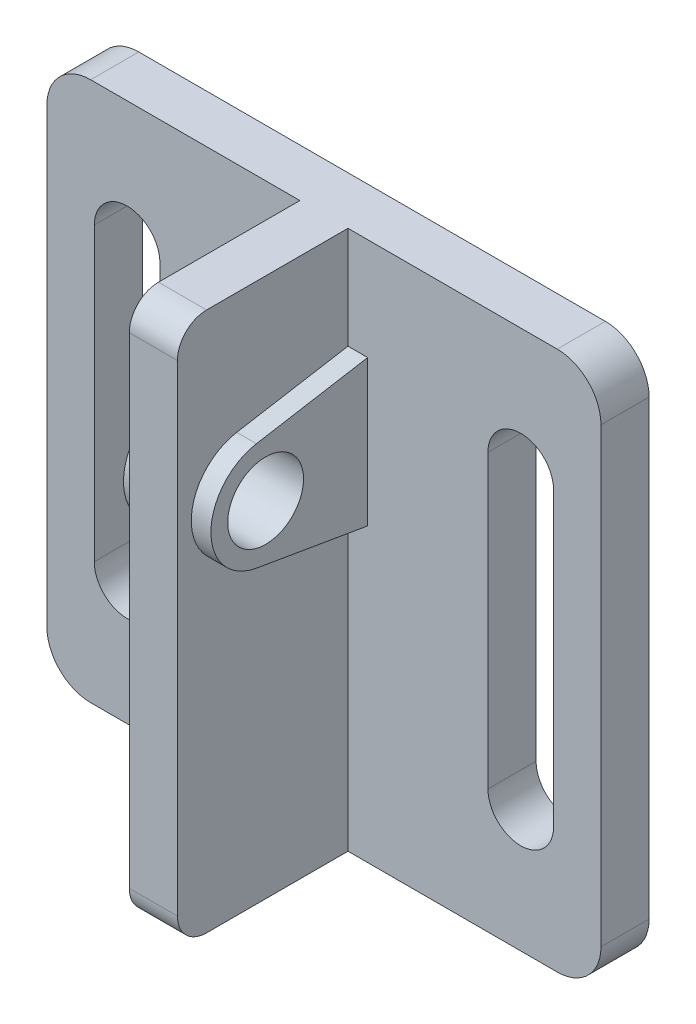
ISO-10303-21;
HEADER;
FILE_DESCRIPTION(('STEP AP214'),'2;1');
FILE_NAME('part.step','',(''),(''),'','','');
FILE_SCHEMA(('AUTOMOTIVE_DESIGN { 1 0 10303 214 1 1 1 1 }'));
ENDSEC;
DATA;
#1=APPLICATION_CONTEXT('core data for automotive mechanical design processes');
#2=APPLICATION_PROTOCOL_DEFINITION('international standard','automotive_design',2000,#1);
#3=PRODUCT_CONTEXT('',#1,'mechanical');
#4=PRODUCT('Part','Part','',(#3));
#5=PRODUCT_RELATED_PRODUCT_CATEGORY('part','',(#4));
#6=PRODUCT_DEFINITION_FORMATION('','',#4);
#7=PRODUCT_DEFINITION_CONTEXT('part definition',#1,'design');
#8=PRODUCT_DEFINITION('design','',#6,#7);
#9=PRODUCT_DEFINITION_SHAPE('','',#8);
#10=(LENGTH_UNIT() NAMED_UNIT(*) SI_UNIT(.MILLI.,.METRE.));
#11=(NAMED_UNIT(*) PLANE_ANGLE_UNIT() SI_UNIT($,.RADIAN.));
#12=(NAMED_UNIT(*) SI_UNIT($,.STERADIAN.) SOLID_ANGLE_UNIT());
#13=UNCERTAINTY_MEASURE_WITH_UNIT(LENGTH_MEASURE(1.E-05),#10,'distance_accuracy_value','');
#14=(GEOMETRIC_REPRESENTATION_CONTEXT(3) GLOBAL_UNCERTAINTY_ASSIGNED_CONTEXT((#13)) GLOBAL_UNIT_ASSIGNED_CONTEXT((#10,
#11,#12)) REPRESENTATION_CONTEXT('',''));
#15=CARTESIAN_POINT('',(0.,0.,0.));
#16=DIRECTION('',(0.,0.,1.));
#17=DIRECTION('',(1.,0.,0.));
#18=AXIS2_PLACEMENT_3D('',#15,#16,#17);
#19=CARTESIAN_POINT('',(0.,0.,3.3));
#20=DIRECTION('',(0.,0.,1.));
#21=DIRECTION('',(1.,0.,0.));
#22=AXIS2_PLACEMENT_3D('',#19,#20,#21);
#23=PLANE('',#22);
#24=CARTESIAN_POINT('',(13.5,10.,3.3));
#25=DIRECTION('',(0.,0.,1.));
#26=DIRECTION('',(-1.,0.,0.));
#27=AXIS2_PLACEMENT_3D('',#24,#25,#26);
#28=CIRCLE('',#27,2.25);
#29=CARTESIAN_POINT('',(15.75,10.,3.3));
#30=VERTEX_POINT('',#29);
#31=CARTESIAN_POINT('',(11.25,10.,3.3));
#32=VERTEX_POINT('',#31);
#33=EDGE_CURVE('E322',#30,#32,#28,.T.);
#34=ORIENTED_EDGE('',*,*,#33,.F.);
#35=DIRECTION('',(0.,1.,0.));
#36=VECTOR('',#35,1.);
#37=CARTESIAN_POINT('',(15.75,10.,3.3));
#38=LINE('',#37,#36);
#39=CARTESIAN_POINT('',(15.75,-10.,3.3));
#40=VERTEX_POINT('',#39);
#41=EDGE_CURVE('E330',#40,#30,#38,.T.);
#42=ORIENTED_EDGE('',*,*,#41,.F.);
#43=CARTESIAN_POINT('',(13.5,-10.,3.3));
#44=DIRECTION('',(0.,0.,1.));
#45=DIRECTION('',(-1.,0.,0.));
#46=AXIS2_PLACEMENT_3D('',#43,#44,#45);
#47=CIRCLE('',#46,2.25);
#48=CARTESIAN_POINT('',(11.25,-10.,3.3));
#49=VERTEX_POINT('',#48);
#50=EDGE_CURVE('E327',#49,#40,#47,.T.);
#51=ORIENTED_EDGE('',*,*,#50,.F.);
#52=DIRECTION('',(0.,-1.,0.));
#53=VECTOR('',#52,1.);
#54=CARTESIAN_POINT('',(11.25,10.,3.3));
#55=LINE('',#54,#53);
#56=EDGE_CURVE('E324',#32,#49,#55,.T.);
#57=ORIENTED_EDGE('',*,*,#56,.F.);
#58=EDGE_LOOP('',(#34,#42,#51,#57));
#59=FACE_BOUND('',#58,.T.);
#60=DIRECTION('',(0.,1.,0.));
#61=VECTOR('',#60,1.);
#62=CARTESIAN_POINT('',(1.65,18.5,3.3));
#63=LINE('',#62,#61);
#64=CARTESIAN_POINT('',(1.65,11.5,3.3));
#65=VERTEX_POINT('',#64);
#66=CARTESIAN_POINT('',(1.65,18.5,3.3));
#67=VERTEX_POINT('',#66);
#68=EDGE_CURVE('E292',#65,#67,#63,.T.);
#69=ORIENTED_EDGE('',*,*,#68,.F.);
#70=DIRECTION('',(-1.,0.,0.));
#71=VECTOR('',#70,1.);
#72=CARTESIAN_POINT('',(3.,11.5,3.3));
#73=LINE('',#72,#71);
#74=CARTESIAN_POINT('',(3.,11.5,3.3));
#75=VERTEX_POINT('',#74);
#76=EDGE_CURVE('E57',#75,#65,#73,.T.);
#77=ORIENTED_EDGE('',*,*,#76,.F.);
#78=DIRECTION('',(0.,1.,0.));
#79=VECTOR('',#78,1.);
#80=CARTESIAN_POINT('',(3.,1.5,3.3));
#81=LINE('',#80,#79);
#82=CARTESIAN_POINT('',(3.,1.5,3.3));
#83=VERTEX_POINT('',#82);
#84=EDGE_CURVE('E267',#83,#75,#81,.T.);
#85=ORIENTED_EDGE('',*,*,#84,.F.);
#86=DIRECTION('',(-1.,0.,0.));
#87=VECTOR('',#86,1.);
#88=CARTESIAN_POINT('',(3.,1.5,3.3));
#89=LINE('',#88,#87);
#90=CARTESIAN_POINT('',(1.65,1.5,3.3));
#91=VERTEX_POINT('',#90);
#92=EDGE_CURVE('E277',#83,#91,#89,.T.);
#93=ORIENTED_EDGE('',*,*,#92,.T.);
#94=CARTESIAN_POINT('',(1.65,-18.5,3.3));
#95=VERTEX_POINT('',#94);
#96=EDGE_CURVE('E301',#95,#91,#63,.T.);
#97=ORIENTED_EDGE('',*,*,#96,.F.);
#98=DIRECTION('',(1.,0.,0.));
#99=VECTOR('',#98,1.);
#100=CARTESIAN_POINT('',(-19.,-18.5,3.3));
#101=LINE('',#100,#99);
#102=CARTESIAN_POINT('',(16.,-18.5,3.3));
#103=VERTEX_POINT('',#102);
#104=EDGE_CURVE('E388',#95,#103,#101,.T.);
#105=ORIENTED_EDGE('',*,*,#104,.T.);
#106=CARTESIAN_POINT('',(16.,-15.5,3.3));
#107=DIRECTION('',(0.,0.,1.));
#108=DIRECTION('',(1.,0.,0.));
#109=AXIS2_PLACEMENT_3D('',#106,#107,#108);
#110=CIRCLE('',#109,3.);
#111=CARTESIAN_POINT('',(19.,-15.5,3.3));
#112=VERTEX_POINT('',#111);
#113=EDGE_CURVE('E424',#103,#112,#110,.T.);
#114=ORIENTED_EDGE('',*,*,#113,.T.);
#115=DIRECTION('',(0.,1.,0.));
#116=VECTOR('',#115,1.);
#117=CARTESIAN_POINT('',(19.,18.5,3.3));
#118=LINE('',#117,#116);
#119=CARTESIAN_POINT('',(19.,15.5,3.3));
#120=VERTEX_POINT('',#119);
#121=EDGE_CURVE('E377',#112,#120,#118,.T.);
#122=ORIENTED_EDGE('',*,*,#121,.T.);
#123=CARTESIAN_POINT('',(16.,15.5,3.3));
#124=DIRECTION('',(0.,0.,1.));
#125=DIRECTION('',(1.,0.,0.));
#126=AXIS2_PLACEMENT_3D('',#123,#124,#125);
#127=CIRCLE('',#126,3.);
#128=CARTESIAN_POINT('',(16.,18.5,3.3));
#129=VERTEX_POINT('',#128);
#130=EDGE_CURVE('E422',#120,#129,#127,.T.);
#131=ORIENTED_EDGE('',*,*,#130,.T.);
#132=DIRECTION('',(-1.,0.,0.));
#133=VECTOR('',#132,1.);
#134=CARTESIAN_POINT('',(-19.,18.5,3.3));
#135=LINE('',#134,#133);
#136=EDGE_CURVE('E382',#129,#67,#135,.T.);
#137=ORIENTED_EDGE('',*,*,#136,.T.);
#138=EDGE_LOOP('',(#69,#77,#85,#93,#97,#105,#114,#122,#131,#137));
#139=FACE_BOUND('',#138,.T.);
#140=ADVANCED_FACE('F34',(#59,#139),#23,.T.);
#141=CARTESIAN_POINT('',(1.65,18.5,15.));
#142=DIRECTION('',(-1.,0.,0.));
#143=DIRECTION('',(0.,0.,1.));
#144=AXIS2_PLACEMENT_3D('',#141,#142,#143);
#145=PLANE('',#144);
#146=DIRECTION('',(0.,-0.168373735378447,0.985723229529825));
#147=VECTOR('',#146,1.);
#148=CARTESIAN_POINT('',(1.65,11.5,3.3));
#149=LINE('',#148,#147);
#150=CARTESIAN_POINT('',(1.65,10.1964621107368,10.9314015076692));
#151=VERTEX_POINT('',#150);
#152=EDGE_CURVE('E258',#65,#151,#149,.T.);
#153=ORIENTED_EDGE('',*,*,#152,.F.);
#154=ORIENTED_EDGE('',*,*,#68,.T.);
#155=DIRECTION('',(0.,0.,-1.));
#156=VECTOR('',#155,1.);
#157=CARTESIAN_POINT('',(1.65,18.5,15.));
#158=LINE('',#157,#156);
#159=CARTESIAN_POINT('',(1.65,18.5,13.));
#160=VERTEX_POINT('',#159);
#161=EDGE_CURVE('E311',#160,#67,#158,.T.);
#162=ORIENTED_EDGE('',*,*,#161,.F.);
#163=CARTESIAN_POINT('',(1.65,16.5,13.));
#164=DIRECTION('',(-1.,0.,0.));
#165=DIRECTION('',(0.,0.,1.));
#166=AXIS2_PLACEMENT_3D('',#163,#164,#165);
#167=CIRCLE('',#166,2.);
#168=CARTESIAN_POINT('',(1.65,16.5,15.));
#169=VERTEX_POINT('',#168);
#170=EDGE_CURVE('E445',#160,#169,#167,.F.);
#171=ORIENTED_EDGE('',*,*,#170,.T.);
#172=DIRECTION('',(0.,1.,0.));
#173=VECTOR('',#172,1.);
#174=CARTESIAN_POINT('',(1.65,18.5,15.));
#175=LINE('',#174,#173);
#176=CARTESIAN_POINT('',(1.65,-16.5,15.));
#177=VERTEX_POINT('',#176);
#178=EDGE_CURVE('E293',#177,#169,#175,.T.);
#179=ORIENTED_EDGE('',*,*,#178,.F.);
#180=CARTESIAN_POINT('',(1.65,-16.5,13.));
#181=DIRECTION('',(-1.,0.,0.));
#182=DIRECTION('',(0.,0.,1.));
#183=AXIS2_PLACEMENT_3D('',#180,#181,#182);
#184=CIRCLE('',#183,2.);
#185=CARTESIAN_POINT('',(1.65,-18.5,13.));
#186=VERTEX_POINT('',#185);
#187=EDGE_CURVE('E447',#177,#186,#184,.F.);
#188=ORIENTED_EDGE('',*,*,#187,.T.);
#189=DIRECTION('',(0.,0.,-1.));
#190=VECTOR('',#189,1.);
#191=CARTESIAN_POINT('',(1.65,-18.5,15.));
#192=LINE('',#191,#190);
#193=EDGE_CURVE('E300',#186,#95,#192,.T.);
#194=ORIENTED_EDGE('',*,*,#193,.T.);
#195=ORIENTED_EDGE('',*,*,#96,.T.);
#196=DIRECTION('',(0.,-0.168373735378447,-0.985723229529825));
#197=VECTOR('',#196,1.);
#198=CARTESIAN_POINT('',(1.65,1.5,3.3));
#199=LINE('',#198,#197);
#200=CARTESIAN_POINT('',(1.65,2.80353788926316,10.9314015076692));
#201=VERTEX_POINT('',#200);
#202=EDGE_CURVE('E271',#201,#91,#199,.T.);
#203=ORIENTED_EDGE('',*,*,#202,.F.);
#204=CARTESIAN_POINT('',(1.65,6.5,10.3));
#205=DIRECTION('',(1.,0.,0.));
#206=DIRECTION('',(0.,0.,-1.));
#207=AXIS2_PLACEMENT_3D('',#204,#205,#206);
#208=CIRCLE('',#207,3.75);
#209=EDGE_CURVE('E261',#151,#201,#208,.T.);
#210=ORIENTED_EDGE('',*,*,#209,.F.);
#211=EDGE_LOOP('',(#153,#154,#162,#171,#179,#188,#194,#195,#203,#210));
#212=FACE_BOUND('',#211,.T.);
#213=ADVANCED_FACE('F467',(#212),#145,.F.);
#214=CARTESIAN_POINT('',(19.,18.5,3.3));
#215=DIRECTION('',(-1.,0.,0.));
#216=DIRECTION('',(0.,-1.,0.));
#217=AXIS2_PLACEMENT_3D('',#214,#215,#216);
#218=PLANE('',#217);
#219=ORIENTED_EDGE('',*,*,#121,.F.);
#220=DIRECTION('',(0.,0.,-1.));
#221=VECTOR('',#220,1.);
#222=CARTESIAN_POINT('',(19.,-15.5,3.3));
#223=LINE('',#222,#221);
#224=CARTESIAN_POINT('',(19.,-15.5,0.));
#225=VERTEX_POINT('',#224);
#226=EDGE_CURVE('E430',#112,#225,#223,.T.);
#227=ORIENTED_EDGE('',*,*,#226,.T.);
#228=DIRECTION('',(0.,1.,0.));
#229=VECTOR('',#228,1.);
#230=CARTESIAN_POINT('',(19.,18.5,0.));
#231=LINE('',#230,#229);
#232=CARTESIAN_POINT('',(19.,15.5,0.));
#233=VERTEX_POINT('',#232);
#234=EDGE_CURVE('E376',#225,#233,#231,.T.);
#235=ORIENTED_EDGE('',*,*,#234,.T.);
#236=DIRECTION('',(0.,0.,-1.));
#237=VECTOR('',#236,1.);
#238=CARTESIAN_POINT('',(19.,15.5,3.3));
#239=LINE('',#238,#237);
#240=EDGE_CURVE('E428',#233,#120,#239,.F.);
#241=ORIENTED_EDGE('',*,*,#240,.T.);
#242=EDGE_LOOP('',(#219,#227,#235,#241));
#243=FACE_BOUND('',#242,.T.);
#244=ADVANCED_FACE('F504',(#243),#218,.F.);
#245=CARTESIAN_POINT('',(-19.,18.5,3.3));
#246=DIRECTION('',(0.,-1.,0.));
#247=DIRECTION('',(0.,0.,-1.));
#248=AXIS2_PLACEMENT_3D('',#245,#246,#247);
#249=PLANE('',#248);
#250=DIRECTION('',(0.,0.,-1.));
#251=VECTOR('',#250,1.);
#252=CARTESIAN_POINT('',(-1.65,18.5,15.));
#253=LINE('',#252,#251);
#254=CARTESIAN_POINT('',(-1.65,18.5,13.));
#255=VERTEX_POINT('',#254);
#256=CARTESIAN_POINT('',(-1.65,18.5,3.3));
#257=VERTEX_POINT('',#256);
#258=EDGE_CURVE('E309',#255,#257,#253,.T.);
#259=ORIENTED_EDGE('',*,*,#258,.F.);
#260=DIRECTION('',(-1.,0.,0.));
#261=VECTOR('',#260,1.);
#262=CARTESIAN_POINT('',(1.65,18.5,13.));
#263=LINE('',#262,#261);
#264=EDGE_CURVE('E11',#255,#160,#263,.F.);
#265=ORIENTED_EDGE('',*,*,#264,.T.);
#266=ORIENTED_EDGE('',*,*,#161,.T.);
#267=ORIENTED_EDGE('',*,*,#136,.F.);
#268=DIRECTION('',(0.,0.,-1.));
#269=VECTOR('',#268,1.);
#270=CARTESIAN_POINT('',(16.,18.5,3.3));
#271=LINE('',#270,#269);
#272=CARTESIAN_POINT('',(16.,18.5,0.));
#273=VERTEX_POINT('',#272);
#274=EDGE_CURVE('E436',#129,#273,#271,.T.);
#275=ORIENTED_EDGE('',*,*,#274,.T.);
#276=DIRECTION('',(-1.,0.,0.));
#277=VECTOR('',#276,1.);
#278=CARTESIAN_POINT('',(-19.,18.5,0.));
#279=LINE('',#278,#277);
#280=CARTESIAN_POINT('',(-16.,18.5,0.));
#281=VERTEX_POINT('',#280);
#282=EDGE_CURVE('E394',#273,#281,#279,.T.);
#283=ORIENTED_EDGE('',*,*,#282,.T.);
#284=DIRECTION('',(0.,0.,-1.));
#285=VECTOR('',#284,1.);
#286=CARTESIAN_POINT('',(-16.,18.5,3.3));
#287=LINE('',#286,#285);
#288=CARTESIAN_POINT('',(-16.,18.5,3.3));
#289=VERTEX_POINT('',#288);
#290=EDGE_CURVE('E433',#281,#289,#287,.F.);
#291=ORIENTED_EDGE('',*,*,#290,.T.);
#292=EDGE_CURVE('E380',#257,#289,#135,.T.);
#293=ORIENTED_EDGE('',*,*,#292,.F.);
#294=EDGE_LOOP('',(#259,#265,#266,#267,#275,#283,#291,#293));
#295=FACE_BOUND('',#294,.T.);
#296=ADVANCED_FACE('F494',(#295),#249,.F.);
#297=CARTESIAN_POINT('',(-19.,18.5,3.3));
#298=DIRECTION('',(1.,0.,0.));
#299=DIRECTION('',(0.,1.,0.));
#300=AXIS2_PLACEMENT_3D('',#297,#298,#299);
#301=PLANE('',#300);
#302=DIRECTION('',(0.,-1.,0.));
#303=VECTOR('',#302,1.);
#304=CARTESIAN_POINT('',(-19.,18.5,0.));
#305=LINE('',#304,#303);
#306=CARTESIAN_POINT('',(-19.,15.5,0.));
#307=VERTEX_POINT('',#306);
#308=CARTESIAN_POINT('',(-19.,-15.5,0.));
#309=VERTEX_POINT('',#308);
#310=EDGE_CURVE('E397',#307,#309,#305,.T.);
#311=ORIENTED_EDGE('',*,*,#310,.T.);
#312=DIRECTION('',(0.,0.,-1.));
#313=VECTOR('',#312,1.);
#314=CARTESIAN_POINT('',(-19.,-15.5,3.3));
#315=LINE('',#314,#313);
#316=CARTESIAN_POINT('',(-19.,-15.5,3.3));
#317=VERTEX_POINT('',#316);
#318=EDGE_CURVE('E418',#309,#317,#315,.F.);
#319=ORIENTED_EDGE('',*,*,#318,.T.);
#320=DIRECTION('',(0.,-1.,0.));
#321=VECTOR('',#320,1.);
#322=CARTESIAN_POINT('',(-19.,18.5,3.3));
#323=LINE('',#322,#321);
#324=CARTESIAN_POINT('',(-19.,15.5,3.3));
#325=VERTEX_POINT('',#324);
#326=EDGE_CURVE('E385',#325,#317,#323,.T.);
#327=ORIENTED_EDGE('',*,*,#326,.F.);
#328=DIRECTION('',(0.,0.,-1.));
#329=VECTOR('',#328,1.);
#330=CARTESIAN_POINT('',(-19.,15.5,3.3));
#331=LINE('',#330,#329);
#332=EDGE_CURVE('E415',#325,#307,#331,.T.);
#333=ORIENTED_EDGE('',*,*,#332,.T.);
#334=EDGE_LOOP('',(#311,#319,#327,#333));
#335=FACE_BOUND('',#334,.T.);
#336=ADVANCED_FACE('F516',(#335),#301,.F.);
#337=CARTESIAN_POINT('',(-19.,-18.5,3.3));
#338=DIRECTION('',(0.,1.,0.));
#339=DIRECTION('',(0.,0.,1.));
#340=AXIS2_PLACEMENT_3D('',#337,#338,#339);
#341=PLANE('',#340);
#342=ORIENTED_EDGE('',*,*,#193,.F.);
#343=DIRECTION('',(1.,0.,0.));
#344=VECTOR('',#343,1.);
#345=CARTESIAN_POINT('',(-1.65,-18.5,13.));
#346=LINE('',#345,#344);
#347=CARTESIAN_POINT('',(-1.65,-18.5,13.));
#348=VERTEX_POINT('',#347);
#349=EDGE_CURVE('E449',#186,#348,#346,.F.);
#350=ORIENTED_EDGE('',*,*,#349,.T.);
#351=DIRECTION('',(0.,0.,-1.));
#352=VECTOR('',#351,1.);
#353=CARTESIAN_POINT('',(-1.65,-18.5,15.));
#354=LINE('',#353,#352);
#355=CARTESIAN_POINT('',(-1.65,-18.5,3.3));
#356=VERTEX_POINT('',#355);
#357=EDGE_CURVE('E306',#348,#356,#354,.T.);
#358=ORIENTED_EDGE('',*,*,#357,.T.);
#359=CARTESIAN_POINT('',(-16.,-18.5,3.3));
#360=VERTEX_POINT('',#359);
#361=EDGE_CURVE('E389',#360,#356,#101,.T.);
#362=ORIENTED_EDGE('',*,*,#361,.F.);
#363=DIRECTION('',(0.,0.,-1.));
#364=VECTOR('',#363,1.);
#365=CARTESIAN_POINT('',(-16.,-18.5,3.3));
#366=LINE('',#365,#364);
#367=CARTESIAN_POINT('',(-16.,-18.5,0.));
#368=VERTEX_POINT('',#367);
#369=EDGE_CURVE('E404',#360,#368,#366,.T.);
#370=ORIENTED_EDGE('',*,*,#369,.T.);
#371=DIRECTION('',(1.,0.,0.));
#372=VECTOR('',#371,1.);
#373=CARTESIAN_POINT('',(-19.,-18.5,0.));
#374=LINE('',#373,#372);
#375=CARTESIAN_POINT('',(16.,-18.5,0.));
#376=VERTEX_POINT('',#375);
#377=EDGE_CURVE('E381',#368,#376,#374,.T.);
#378=ORIENTED_EDGE('',*,*,#377,.T.);
#379=DIRECTION('',(0.,0.,-1.));
#380=VECTOR('',#379,1.);
#381=CARTESIAN_POINT('',(16.,-18.5,3.3));
#382=LINE('',#381,#380);
#383=EDGE_CURVE('E391',#376,#103,#382,.F.);
#384=ORIENTED_EDGE('',*,*,#383,.T.);
#385=ORIENTED_EDGE('',*,*,#104,.F.);
#386=EDGE_LOOP('',(#342,#350,#358,#362,#370,#378,#384,#385));
#387=FACE_BOUND('',#386,.T.);
#388=ADVANCED_FACE('F471',(#387),#341,.F.);
#389=DIRECTION('',(1.,0.,0.));
#390=VECTOR('',#389,1.);
#391=CARTESIAN_POINT('',(-3.,1.5,3.3));
#392=LINE('',#391,#390);
#393=CARTESIAN_POINT('',(-3.,1.5,3.3));
#394=VERTEX_POINT('',#393);
#395=CARTESIAN_POINT('',(-1.65,1.5,3.3));
#396=VERTEX_POINT('',#395);
#397=EDGE_CURVE('E248',#394,#396,#392,.T.);
#398=ORIENTED_EDGE('',*,*,#397,.F.);
#399=DIRECTION('',(0.,1.,0.));
#400=VECTOR('',#399,1.);
#401=CARTESIAN_POINT('',(-3.,1.5,3.3));
#402=LINE('',#401,#400);
#403=CARTESIAN_POINT('',(-3.,11.5,3.3));
#404=VERTEX_POINT('',#403);
#405=EDGE_CURVE('E232',#394,#404,#402,.T.);
#406=ORIENTED_EDGE('',*,*,#405,.T.);
#407=DIRECTION('',(1.,0.,0.));
#408=VECTOR('',#407,1.);
#409=CARTESIAN_POINT('',(-3.,11.5,3.3));
#410=LINE('',#409,#408);
#411=CARTESIAN_POINT('',(-1.65,11.5,3.3));
#412=VERTEX_POINT('',#411);
#413=EDGE_CURVE('E526',#404,#412,#410,.T.);
#414=ORIENTED_EDGE('',*,*,#413,.T.);
#415=DIRECTION('',(0.,-1.,0.));
#416=VECTOR('',#415,1.);
#417=CARTESIAN_POINT('',(-1.65,18.5,3.3));
#418=LINE('',#417,#416);
#419=EDGE_CURVE('E297',#257,#412,#418,.T.);
#420=ORIENTED_EDGE('',*,*,#419,.F.);
#421=ORIENTED_EDGE('',*,*,#292,.T.);
#422=CARTESIAN_POINT('',(-16.,15.5,3.3));
#423=DIRECTION('',(0.,0.,1.));
#424=DIRECTION('',(1.,0.,0.));
#425=AXIS2_PLACEMENT_3D('',#422,#423,#424);
#426=CIRCLE('',#425,3.);
#427=EDGE_CURVE('E420',#289,#325,#426,.T.);
#428=ORIENTED_EDGE('',*,*,#427,.T.);
#429=ORIENTED_EDGE('',*,*,#326,.T.);
#430=CARTESIAN_POINT('',(-16.,-15.5,3.3));
#431=DIRECTION('',(0.,0.,1.));
#432=DIRECTION('',(1.,0.,0.));
#433=AXIS2_PLACEMENT_3D('',#430,#431,#432);
#434=CIRCLE('',#433,3.);
#435=EDGE_CURVE('E426',#317,#360,#434,.T.);
#436=ORIENTED_EDGE('',*,*,#435,.T.);
#437=ORIENTED_EDGE('',*,*,#361,.T.);
#438=EDGE_CURVE('E257',#396,#356,#418,.T.);
#439=ORIENTED_EDGE('',*,*,#438,.F.);
#440=EDGE_LOOP('',(#398,#406,#414,#420,#421,#428,#429,#436,#437,#439));
#441=FACE_BOUND('',#440,.T.);
#442=CARTESIAN_POINT('',(-13.5,10.,3.3));
#443=DIRECTION('',(0.,0.,1.));
#444=DIRECTION('',(1.,0.,0.));
#445=AXIS2_PLACEMENT_3D('',#442,#443,#444);
#446=CIRCLE('',#445,2.25);
#447=CARTESIAN_POINT('',(-11.25,10.,3.3));
#448=VERTEX_POINT('',#447);
#449=CARTESIAN_POINT('',(-15.75,9.99999999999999,3.3));
#450=VERTEX_POINT('',#449);
#451=EDGE_CURVE('E353',#448,#450,#446,.T.);
#452=ORIENTED_EDGE('',*,*,#451,.F.);
#453=DIRECTION('',(0.,1.,0.));
#454=VECTOR('',#453,1.);
#455=CARTESIAN_POINT('',(-11.25,10.,3.3));
#456=LINE('',#455,#454);
#457=CARTESIAN_POINT('',(-11.25,-10.,3.3));
#458=VERTEX_POINT('',#457);
#459=EDGE_CURVE('E361',#458,#448,#456,.T.);
#460=ORIENTED_EDGE('',*,*,#459,.F.);
#461=CARTESIAN_POINT('',(-13.5,-10.,3.3));
#462=DIRECTION('',(0.,0.,1.));
#463=DIRECTION('',(1.,0.,0.));
#464=AXIS2_PLACEMENT_3D('',#461,#462,#463);
#465=CIRCLE('',#464,2.25);
#466=CARTESIAN_POINT('',(-15.75,-10.,3.3));
#467=VERTEX_POINT('',#466);
#468=EDGE_CURVE('E358',#467,#458,#465,.T.);
#469=ORIENTED_EDGE('',*,*,#468,.F.);
#470=DIRECTION('',(0.,-1.,0.));
#471=VECTOR('',#470,1.);
#472=CARTESIAN_POINT('',(-15.75,9.99999999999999,3.3));
#473=LINE('',#472,#471);
#474=EDGE_CURVE('E355',#450,#467,#473,.T.);
#475=ORIENTED_EDGE('',*,*,#474,.F.);
#476=EDGE_LOOP('',(#452,#460,#469,#475));
#477=FACE_BOUND('',#476,.T.);
#478=ADVANCED_FACE('F254',(#441,#477),#23,.T.);
#479=CARTESIAN_POINT('',(0.,0.,0.));
#480=DIRECTION('',(0.,0.,1.));
#481=DIRECTION('',(1.,0.,0.));
#482=AXIS2_PLACEMENT_3D('',#479,#480,#481);
#483=PLANE('',#482);
#484=DIRECTION('',(0.,-1.,0.));
#485=VECTOR('',#484,1.);
#486=CARTESIAN_POINT('',(15.75,10.,0.));
#487=LINE('',#486,#485);
#488=CARTESIAN_POINT('',(15.75,10.,0.));
#489=VERTEX_POINT('',#488);
#490=CARTESIAN_POINT('',(15.75,-10.,0.));
#491=VERTEX_POINT('',#490);
#492=EDGE_CURVE('E316',#489,#491,#487,.T.);
#493=ORIENTED_EDGE('',*,*,#492,.F.);
#494=CARTESIAN_POINT('',(13.5,10.,0.));
#495=DIRECTION('',(0.,0.,1.));
#496=DIRECTION('',(1.,0.,0.));
#497=AXIS2_PLACEMENT_3D('',#494,#495,#496);
#498=CIRCLE('',#497,2.25);
#499=CARTESIAN_POINT('',(11.25,10.,0.));
#500=VERTEX_POINT('',#499);
#501=EDGE_CURVE('E319',#500,#489,#498,.F.);
#502=ORIENTED_EDGE('',*,*,#501,.F.);
#503=DIRECTION('',(0.,1.,0.));
#504=VECTOR('',#503,1.);
#505=CARTESIAN_POINT('',(11.25,10.,0.));
#506=LINE('',#505,#504);
#507=CARTESIAN_POINT('',(11.25,-10.,0.));
#508=VERTEX_POINT('',#507);
#509=EDGE_CURVE('E336',#508,#500,#506,.T.);
#510=ORIENTED_EDGE('',*,*,#509,.F.);
#511=CARTESIAN_POINT('',(13.5,-10.,0.));
#512=DIRECTION('',(0.,0.,1.));
#513=DIRECTION('',(1.,0.,0.));
#514=AXIS2_PLACEMENT_3D('',#511,#512,#513);
#515=CIRCLE('',#514,2.25);
#516=EDGE_CURVE('E314',#491,#508,#515,.F.);
#517=ORIENTED_EDGE('',*,*,#516,.F.);
#518=EDGE_LOOP('',(#493,#502,#510,#517));
#519=FACE_BOUND('',#518,.T.);
#520=DIRECTION('',(0.,-1.,0.));
#521=VECTOR('',#520,1.);
#522=CARTESIAN_POINT('',(-11.25,10.,0.));
#523=LINE('',#522,#521);
#524=CARTESIAN_POINT('',(-11.25,10.,0.));
#525=VERTEX_POINT('',#524);
#526=CARTESIAN_POINT('',(-11.25,-10.,0.));
#527=VERTEX_POINT('',#526);
#528=EDGE_CURVE('E347',#525,#527,#523,.T.);
#529=ORIENTED_EDGE('',*,*,#528,.F.);
#530=CARTESIAN_POINT('',(-13.5,10.,0.));
#531=DIRECTION('',(0.,0.,1.));
#532=DIRECTION('',(1.,0.,0.));
#533=AXIS2_PLACEMENT_3D('',#530,#531,#532);
#534=CIRCLE('',#533,2.25);
#535=CARTESIAN_POINT('',(-15.75,9.99999999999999,0.));
#536=VERTEX_POINT('',#535);
#537=EDGE_CURVE('E350',#536,#525,#534,.F.);
#538=ORIENTED_EDGE('',*,*,#537,.F.);
#539=DIRECTION('',(0.,1.,0.));
#540=VECTOR('',#539,1.);
#541=CARTESIAN_POINT('',(-15.75,9.99999999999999,0.));
#542=LINE('',#541,#540);
#543=CARTESIAN_POINT('',(-15.75,-10.,0.));
#544=VERTEX_POINT('',#543);
#545=EDGE_CURVE('E367',#544,#536,#542,.T.);
#546=ORIENTED_EDGE('',*,*,#545,.F.);
#547=CARTESIAN_POINT('',(-13.5,-10.,0.));
#548=DIRECTION('',(0.,0.,1.));
#549=DIRECTION('',(1.,0.,0.));
#550=AXIS2_PLACEMENT_3D('',#547,#548,#549);
#551=CIRCLE('',#550,2.25);
#552=EDGE_CURVE('E345',#527,#544,#551,.F.);
#553=ORIENTED_EDGE('',*,*,#552,.F.);
#554=EDGE_LOOP('',(#529,#538,#546,#553));
#555=FACE_BOUND('',#554,.T.);
#556=ORIENTED_EDGE('',*,*,#377,.F.);
#557=CARTESIAN_POINT('',(-16.,-15.5,0.));
#558=DIRECTION('',(0.,0.,1.));
#559=DIRECTION('',(1.,0.,0.));
#560=AXIS2_PLACEMENT_3D('',#557,#558,#559);
#561=CIRCLE('',#560,3.);
#562=EDGE_CURVE('E413',#368,#309,#561,.F.);
#563=ORIENTED_EDGE('',*,*,#562,.T.);
#564=ORIENTED_EDGE('',*,*,#310,.F.);
#565=CARTESIAN_POINT('',(-16.,15.5,0.));
#566=DIRECTION('',(0.,0.,1.));
#567=DIRECTION('',(1.,0.,0.));
#568=AXIS2_PLACEMENT_3D('',#565,#566,#567);
#569=CIRCLE('',#568,3.);
#570=EDGE_CURVE('E407',#307,#281,#569,.F.);
#571=ORIENTED_EDGE('',*,*,#570,.T.);
#572=ORIENTED_EDGE('',*,*,#282,.F.);
#573=CARTESIAN_POINT('',(16.,15.5,0.));
#574=DIRECTION('',(0.,0.,1.));
#575=DIRECTION('',(1.,0.,0.));
#576=AXIS2_PLACEMENT_3D('',#573,#574,#575);
#577=CIRCLE('',#576,3.);
#578=EDGE_CURVE('E409',#273,#233,#577,.F.);
#579=ORIENTED_EDGE('',*,*,#578,.T.);
#580=ORIENTED_EDGE('',*,*,#234,.F.);
#581=CARTESIAN_POINT('',(16.,-15.5,0.));
#582=DIRECTION('',(0.,0.,1.));
#583=DIRECTION('',(1.,0.,0.));
#584=AXIS2_PLACEMENT_3D('',#581,#582,#583);
#585=CIRCLE('',#584,3.);
#586=EDGE_CURVE('E411',#225,#376,#585,.F.);
#587=ORIENTED_EDGE('',*,*,#586,.T.);
#588=EDGE_LOOP('',(#556,#563,#564,#571,#572,#579,#580,#587));
#589=FACE_BOUND('',#588,.T.);
#590=ADVANCED_FACE('F502',(#519,#555,#589),#483,.F.);
#591=CARTESIAN_POINT('',(-16.,-15.5,3.3));
#592=DIRECTION('',(0.,0.,-1.));
#593=DIRECTION('',(-1.,0.,0.));
#594=AXIS2_PLACEMENT_3D('',#591,#592,#593);
#595=CYLINDRICAL_SURFACE('',#594,3.);
#596=ORIENTED_EDGE('',*,*,#435,.F.);
#597=ORIENTED_EDGE('',*,*,#318,.F.);
#598=ORIENTED_EDGE('',*,*,#562,.F.);
#599=ORIENTED_EDGE('',*,*,#369,.F.);
#600=EDGE_LOOP('',(#596,#597,#598,#599));
#601=FACE_BOUND('',#600,.T.);
#602=ADVANCED_FACE('F512',(#601),#595,.T.);
#603=CARTESIAN_POINT('',(16.,-15.5,3.3));
#604=DIRECTION('',(0.,0.,-1.));
#605=DIRECTION('',(-1.,0.,0.));
#606=AXIS2_PLACEMENT_3D('',#603,#604,#605);
#607=CYLINDRICAL_SURFACE('',#606,3.);
#608=ORIENTED_EDGE('',*,*,#113,.F.);
#609=ORIENTED_EDGE('',*,*,#383,.F.);
#610=ORIENTED_EDGE('',*,*,#586,.F.);
#611=ORIENTED_EDGE('',*,*,#226,.F.);
#612=EDGE_LOOP('',(#608,#609,#610,#611));
#613=FACE_BOUND('',#612,.T.);
#614=ADVANCED_FACE('F507',(#613),#607,.T.);
#615=CARTESIAN_POINT('',(16.,15.5,3.3));
#616=DIRECTION('',(0.,0.,-1.));
#617=DIRECTION('',(-1.,0.,0.));
#618=AXIS2_PLACEMENT_3D('',#615,#616,#617);
#619=CYLINDRICAL_SURFACE('',#618,3.);
#620=ORIENTED_EDGE('',*,*,#130,.F.);
#621=ORIENTED_EDGE('',*,*,#240,.F.);
#622=ORIENTED_EDGE('',*,*,#578,.F.);
#623=ORIENTED_EDGE('',*,*,#274,.F.);
#624=EDGE_LOOP('',(#620,#621,#622,#623));
#625=FACE_BOUND('',#624,.T.);
#626=ADVANCED_FACE('F497',(#625),#619,.T.);
#627=CARTESIAN_POINT('',(-16.,15.5,3.3));
#628=DIRECTION('',(0.,0.,-1.));
#629=DIRECTION('',(-1.,0.,0.));
#630=AXIS2_PLACEMENT_3D('',#627,#628,#629);
#631=CYLINDRICAL_SURFACE('',#630,3.);
#632=ORIENTED_EDGE('',*,*,#427,.F.);
#633=ORIENTED_EDGE('',*,*,#290,.F.);
#634=ORIENTED_EDGE('',*,*,#570,.F.);
#635=ORIENTED_EDGE('',*,*,#332,.F.);
#636=EDGE_LOOP('',(#632,#633,#634,#635));
#637=FACE_BOUND('',#636,.T.);
#638=ADVANCED_FACE('F521',(#637),#631,.T.);
#639=CARTESIAN_POINT('',(-13.5,10.,-0.00100000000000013));
#640=DIRECTION('',(0.,0.,1.));
#641=DIRECTION('',(1.,0.,0.));
#642=AXIS2_PLACEMENT_3D('',#639,#640,#641);
#643=CYLINDRICAL_SURFACE('',#642,2.25);
#644=ORIENTED_EDGE('',*,*,#537,.T.);
#645=DIRECTION('',(0.,0.,1.));
#646=VECTOR('',#645,1.);
#647=CARTESIAN_POINT('',(-11.25,10.,-0.00100000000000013));
#648=LINE('',#647,#646);
#649=EDGE_CURVE('E365',#525,#448,#648,.T.);
#650=ORIENTED_EDGE('',*,*,#649,.T.);
#651=ORIENTED_EDGE('',*,*,#451,.T.);
#652=DIRECTION('',(0.,0.,1.));
#653=VECTOR('',#652,1.);
#654=CARTESIAN_POINT('',(-15.75,9.99999999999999,-0.00100000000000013));
#655=LINE('',#654,#653);
#656=EDGE_CURVE('E364',#536,#450,#655,.T.);
#657=ORIENTED_EDGE('',*,*,#656,.F.);
#658=EDGE_LOOP('',(#644,#650,#651,#657));
#659=FACE_BOUND('',#658,.T.);
#660=ADVANCED_FACE('F569',(#659),#643,.F.);
#661=CARTESIAN_POINT('',(-11.25,10.,-0.00100000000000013));
#662=DIRECTION('',(1.,0.,0.));
#663=DIRECTION('',(0.,1.,0.));
#664=AXIS2_PLACEMENT_3D('',#661,#662,#663);
#665=PLANE('',#664);
#666=ORIENTED_EDGE('',*,*,#528,.T.);
#667=DIRECTION('',(0.,0.,1.));
#668=VECTOR('',#667,1.);
#669=CARTESIAN_POINT('',(-11.25,-10.,-0.00100000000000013));
#670=LINE('',#669,#668);
#671=EDGE_CURVE('E368',#527,#458,#670,.T.);
#672=ORIENTED_EDGE('',*,*,#671,.T.);
#673=ORIENTED_EDGE('',*,*,#459,.T.);
#674=ORIENTED_EDGE('',*,*,#649,.F.);
#675=EDGE_LOOP('',(#666,#672,#673,#674));
#676=FACE_BOUND('',#675,.T.);
#677=ADVANCED_FACE('F573',(#676),#665,.F.);
#678=CARTESIAN_POINT('',(-13.5,-10.,-0.00100000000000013));
#679=DIRECTION('',(0.,0.,1.));
#680=DIRECTION('',(1.,0.,0.));
#681=AXIS2_PLACEMENT_3D('',#678,#679,#680);
#682=CYLINDRICAL_SURFACE('',#681,2.25);
#683=ORIENTED_EDGE('',*,*,#552,.T.);
#684=DIRECTION('',(0.,0.,1.));
#685=VECTOR('',#684,1.);
#686=CARTESIAN_POINT('',(-15.75,-10.,-0.00100000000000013));
#687=LINE('',#686,#685);
#688=EDGE_CURVE('E370',#544,#467,#687,.T.);
#689=ORIENTED_EDGE('',*,*,#688,.T.);
#690=ORIENTED_EDGE('',*,*,#468,.T.);
#691=ORIENTED_EDGE('',*,*,#671,.F.);
#692=EDGE_LOOP('',(#683,#689,#690,#691));
#693=FACE_BOUND('',#692,.T.);
#694=ADVANCED_FACE('F578',(#693),#682,.F.);
#695=CARTESIAN_POINT('',(-15.75,9.99999999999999,-0.00100000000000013));
#696=DIRECTION('',(-1.,0.,0.));
#697=DIRECTION('',(0.,-1.,0.));
#698=AXIS2_PLACEMENT_3D('',#695,#696,#697);
#699=PLANE('',#698);
#700=ORIENTED_EDGE('',*,*,#545,.T.);
#701=ORIENTED_EDGE('',*,*,#656,.T.);
#702=ORIENTED_EDGE('',*,*,#474,.T.);
#703=ORIENTED_EDGE('',*,*,#688,.F.);
#704=EDGE_LOOP('',(#700,#701,#702,#703));
#705=FACE_BOUND('',#704,.T.);
#706=ADVANCED_FACE('F582',(#705),#699,.F.);
#707=CARTESIAN_POINT('',(13.5,10.,-0.00100000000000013));
#708=DIRECTION('',(0.,0.,1.));
#709=DIRECTION('',(1.,0.,0.));
#710=AXIS2_PLACEMENT_3D('',#707,#708,#709);
#711=CYLINDRICAL_SURFACE('',#710,2.25);
#712=ORIENTED_EDGE('',*,*,#501,.T.);
#713=DIRECTION('',(0.,0.,1.));
#714=VECTOR('',#713,1.);
#715=CARTESIAN_POINT('',(15.75,10.,-0.00100000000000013));
#716=LINE('',#715,#714);
#717=EDGE_CURVE('E334',#489,#30,#716,.T.);
#718=ORIENTED_EDGE('',*,*,#717,.T.);
#719=ORIENTED_EDGE('',*,*,#33,.T.);
#720=DIRECTION('',(0.,0.,1.));
#721=VECTOR('',#720,1.);
#722=CARTESIAN_POINT('',(11.25,10.,-0.00100000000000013));
#723=LINE('',#722,#721);
#724=EDGE_CURVE('E333',#500,#32,#723,.T.);
#725=ORIENTED_EDGE('',*,*,#724,.F.);
#726=EDGE_LOOP('',(#712,#718,#719,#725));
#727=FACE_BOUND('',#726,.T.);
#728=ADVANCED_FACE('F585',(#727),#711,.F.);
#729=CARTESIAN_POINT('',(15.75,10.,-0.00100000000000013));
#730=DIRECTION('',(1.,0.,0.));
#731=DIRECTION('',(0.,0.,-1.));
#732=AXIS2_PLACEMENT_3D('',#729,#730,#731);
#733=PLANE('',#732);
#734=ORIENTED_EDGE('',*,*,#492,.T.);
#735=DIRECTION('',(0.,0.,1.));
#736=VECTOR('',#735,1.);
#737=CARTESIAN_POINT('',(15.75,-10.,-0.00100000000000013));
#738=LINE('',#737,#736);
#739=EDGE_CURVE('E337',#491,#40,#738,.T.);
#740=ORIENTED_EDGE('',*,*,#739,.T.);
#741=ORIENTED_EDGE('',*,*,#41,.T.);
#742=ORIENTED_EDGE('',*,*,#717,.F.);
#743=EDGE_LOOP('',(#734,#740,#741,#742));
#744=FACE_BOUND('',#743,.T.);
#745=ADVANCED_FACE('F592',(#744),#733,.F.);
#746=CARTESIAN_POINT('',(13.5,-10.,-0.00100000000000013));
#747=DIRECTION('',(0.,0.,1.));
#748=DIRECTION('',(1.,0.,0.));
#749=AXIS2_PLACEMENT_3D('',#746,#747,#748);
#750=CYLINDRICAL_SURFACE('',#749,2.25);
#751=ORIENTED_EDGE('',*,*,#516,.T.);
#752=DIRECTION('',(0.,0.,1.));
#753=VECTOR('',#752,1.);
#754=CARTESIAN_POINT('',(11.25,-10.,-0.00100000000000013));
#755=LINE('',#754,#753);
#756=EDGE_CURVE('E339',#508,#49,#755,.T.);
#757=ORIENTED_EDGE('',*,*,#756,.T.);
#758=ORIENTED_EDGE('',*,*,#50,.T.);
#759=ORIENTED_EDGE('',*,*,#739,.F.);
#760=EDGE_LOOP('',(#751,#757,#758,#759));
#761=FACE_BOUND('',#760,.T.);
#762=ADVANCED_FACE('F597',(#761),#750,.F.);
#763=CARTESIAN_POINT('',(11.25,10.,-0.00100000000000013));
#764=DIRECTION('',(-1.,0.,0.));
#765=DIRECTION('',(0.,0.,1.));
#766=AXIS2_PLACEMENT_3D('',#763,#764,#765);
#767=PLANE('',#766);
#768=ORIENTED_EDGE('',*,*,#509,.T.);
#769=ORIENTED_EDGE('',*,*,#724,.T.);
#770=ORIENTED_EDGE('',*,*,#56,.T.);
#771=ORIENTED_EDGE('',*,*,#756,.F.);
#772=EDGE_LOOP('',(#768,#769,#770,#771));
#773=FACE_BOUND('',#772,.T.);
#774=ADVANCED_FACE('F594',(#773),#767,.F.);
#775=CARTESIAN_POINT('',(-1.65,18.5,15.));
#776=DIRECTION('',(1.,0.,0.));
#777=DIRECTION('',(0.,0.,-1.));
#778=AXIS2_PLACEMENT_3D('',#775,#776,#777);
#779=PLANE('',#778);
#780=CARTESIAN_POINT('',(-1.65,6.5,10.3));
#781=DIRECTION('',(1.,0.,0.));
#782=DIRECTION('',(0.,0.,-1.));
#783=AXIS2_PLACEMENT_3D('',#780,#781,#782);
#784=CIRCLE('',#783,3.75);
#785=CARTESIAN_POINT('',(-1.65,10.1964621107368,10.9314015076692));
#786=VERTEX_POINT('',#785);
#787=CARTESIAN_POINT('',(-1.65,2.80353788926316,10.9314015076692));
#788=VERTEX_POINT('',#787);
#789=EDGE_CURVE('E49',#786,#788,#784,.T.);
#790=ORIENTED_EDGE('',*,*,#789,.T.);
#791=DIRECTION('',(0.,-0.168373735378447,-0.985723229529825));
#792=VECTOR('',#791,1.);
#793=CARTESIAN_POINT('',(-1.65,1.5,3.3));
#794=LINE('',#793,#792);
#795=EDGE_CURVE('E640',#788,#396,#794,.T.);
#796=ORIENTED_EDGE('',*,*,#795,.T.);
#797=ORIENTED_EDGE('',*,*,#438,.T.);
#798=ORIENTED_EDGE('',*,*,#357,.F.);
#799=CARTESIAN_POINT('',(-1.65,-16.5,13.));
#800=DIRECTION('',(1.,0.,0.));
#801=DIRECTION('',(0.,0.,-1.));
#802=AXIS2_PLACEMENT_3D('',#799,#800,#801);
#803=CIRCLE('',#802,2.);
#804=CARTESIAN_POINT('',(-1.65,-16.5,15.));
#805=VERTEX_POINT('',#804);
#806=EDGE_CURVE('E42',#348,#805,#803,.F.);
#807=ORIENTED_EDGE('',*,*,#806,.T.);
#808=DIRECTION('',(0.,-1.,0.));
#809=VECTOR('',#808,1.);
#810=CARTESIAN_POINT('',(-1.65,18.5,15.));
#811=LINE('',#810,#809);
#812=CARTESIAN_POINT('',(-1.65,16.5,15.));
#813=VERTEX_POINT('',#812);
#814=EDGE_CURVE('E296',#813,#805,#811,.T.);
#815=ORIENTED_EDGE('',*,*,#814,.F.);
#816=CARTESIAN_POINT('',(-1.65,16.5,13.));
#817=DIRECTION('',(1.,0.,0.));
#818=DIRECTION('',(0.,0.,-1.));
#819=AXIS2_PLACEMENT_3D('',#816,#817,#818);
#820=CIRCLE('',#819,2.);
#821=EDGE_CURVE('E451',#813,#255,#820,.F.);
#822=ORIENTED_EDGE('',*,*,#821,.T.);
#823=ORIENTED_EDGE('',*,*,#258,.T.);
#824=ORIENTED_EDGE('',*,*,#419,.T.);
#825=DIRECTION('',(0.,-0.168373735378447,0.985723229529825));
#826=VECTOR('',#825,1.);
#827=CARTESIAN_POINT('',(-1.65,11.5,3.3));
#828=LINE('',#827,#826);
#829=EDGE_CURVE('E243',#412,#786,#828,.T.);
#830=ORIENTED_EDGE('',*,*,#829,.T.);
#831=EDGE_LOOP('',(#790,#796,#797,#798,#807,#815,#822,#823,#824,#830));
#832=FACE_BOUND('',#831,.T.);
#833=ADVANCED_FACE('F456',(#832),#779,.F.);
#834=CARTESIAN_POINT('',(0.,0.,15.));
#835=DIRECTION('',(0.,0.,1.));
#836=DIRECTION('',(1.,0.,0.));
#837=AXIS2_PLACEMENT_3D('',#834,#835,#836);
#838=PLANE('',#837);
#839=ORIENTED_EDGE('',*,*,#814,.T.);
#840=DIRECTION('',(1.,0.,0.));
#841=VECTOR('',#840,1.);
#842=CARTESIAN_POINT('',(1.65,-16.5,15.));
#843=LINE('',#842,#841);
#844=EDGE_CURVE('E442',#805,#177,#843,.T.);
#845=ORIENTED_EDGE('',*,*,#844,.T.);
#846=ORIENTED_EDGE('',*,*,#178,.T.);
#847=DIRECTION('',(-1.,0.,0.));
#848=VECTOR('',#847,1.);
#849=CARTESIAN_POINT('',(-1.65,16.5,15.));
#850=LINE('',#849,#848);
#851=EDGE_CURVE('E439',#169,#813,#850,.T.);
#852=ORIENTED_EDGE('',*,*,#851,.T.);
#853=EDGE_LOOP('',(#839,#845,#846,#852));
#854=FACE_BOUND('',#853,.T.);
#855=ADVANCED_FACE('F461',(#854),#838,.T.);
#856=CARTESIAN_POINT('',(0.,-16.5,13.));
#857=DIRECTION('',(-1.,0.,0.));
#858=DIRECTION('',(0.,0.,1.));
#859=AXIS2_PLACEMENT_3D('',#856,#857,#858);
#860=CYLINDRICAL_SURFACE('',#859,2.);
#861=ORIENTED_EDGE('',*,*,#806,.F.);
#862=ORIENTED_EDGE('',*,*,#349,.F.);
#863=ORIENTED_EDGE('',*,*,#187,.F.);
#864=ORIENTED_EDGE('',*,*,#844,.F.);
#865=EDGE_LOOP('',(#861,#862,#863,#864));
#866=FACE_BOUND('',#865,.T.);
#867=ADVANCED_FACE('F464',(#866),#860,.T.);
#868=CARTESIAN_POINT('',(0.,16.5,13.));
#869=DIRECTION('',(1.,0.,0.));
#870=DIRECTION('',(0.,0.,-1.));
#871=AXIS2_PLACEMENT_3D('',#868,#869,#870);
#872=CYLINDRICAL_SURFACE('',#871,2.);
#873=ORIENTED_EDGE('',*,*,#170,.F.);
#874=ORIENTED_EDGE('',*,*,#264,.F.);
#875=ORIENTED_EDGE('',*,*,#821,.F.);
#876=ORIENTED_EDGE('',*,*,#851,.F.);
#877=EDGE_LOOP('',(#873,#874,#875,#876));
#878=FACE_BOUND('',#877,.T.);
#879=ADVANCED_FACE('F36',(#878),#872,.T.);
#880=CARTESIAN_POINT('',(3.,11.5,3.3));
#881=DIRECTION('',(0.,-0.985723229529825,-0.168373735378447));
#882=DIRECTION('',(0.,0.168373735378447,-0.985723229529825));
#883=AXIS2_PLACEMENT_3D('',#880,#881,#882);
#884=PLANE('',#883);
#885=ORIENTED_EDGE('',*,*,#152,.T.);
#886=DIRECTION('',(-1.,0.,0.));
#887=VECTOR('',#886,1.);
#888=CARTESIAN_POINT('',(3.,10.1964621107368,10.9314015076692));
#889=LINE('',#888,#887);
#890=CARTESIAN_POINT('',(3.,10.1964621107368,10.9314015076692));
#891=VERTEX_POINT('',#890);
#892=EDGE_CURVE('E288',#891,#151,#889,.T.);
#893=ORIENTED_EDGE('',*,*,#892,.F.);
#894=DIRECTION('',(0.,-0.168373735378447,0.985723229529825));
#895=VECTOR('',#894,1.);
#896=CARTESIAN_POINT('',(3.,11.5,3.3));
#897=LINE('',#896,#895);
#898=EDGE_CURVE('E270',#75,#891,#897,.T.);
#899=ORIENTED_EDGE('',*,*,#898,.F.);
#900=ORIENTED_EDGE('',*,*,#76,.T.);
#901=EDGE_LOOP('',(#885,#893,#899,#900));
#902=FACE_BOUND('',#901,.T.);
#903=ADVANCED_FACE('F487',(#902),#884,.F.);
#904=CARTESIAN_POINT('',(3.,6.5,10.3));
#905=DIRECTION('',(-1.,0.,0.));
#906=DIRECTION('',(0.,0.,1.));
#907=AXIS2_PLACEMENT_3D('',#904,#905,#906);
#908=CYLINDRICAL_SURFACE('',#907,3.75);
#909=ORIENTED_EDGE('',*,*,#209,.T.);
#910=DIRECTION('',(-1.,0.,0.));
#911=VECTOR('',#910,1.);
#912=CARTESIAN_POINT('',(3.,2.80353788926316,10.9314015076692));
#913=LINE('',#912,#911);
#914=CARTESIAN_POINT('',(3.,2.80353788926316,10.9314015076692));
#915=VERTEX_POINT('',#914);
#916=EDGE_CURVE('E285',#915,#201,#913,.T.);
#917=ORIENTED_EDGE('',*,*,#916,.F.);
#918=CARTESIAN_POINT('',(3.,6.5,10.3));
#919=DIRECTION('',(1.,0.,0.));
#920=DIRECTION('',(0.,0.,-1.));
#921=AXIS2_PLACEMENT_3D('',#918,#919,#920);
#922=CIRCLE('',#921,3.75);
#923=EDGE_CURVE('E273',#891,#915,#922,.T.);
#924=ORIENTED_EDGE('',*,*,#923,.F.);
#925=ORIENTED_EDGE('',*,*,#892,.T.);
#926=EDGE_LOOP('',(#909,#917,#924,#925));
#927=FACE_BOUND('',#926,.T.);
#928=ADVANCED_FACE('F479',(#927),#908,.T.);
#929=CARTESIAN_POINT('',(3.,1.5,3.3));
#930=DIRECTION('',(0.,0.985723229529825,-0.168373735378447));
#931=DIRECTION('',(0.,0.168373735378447,0.985723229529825));
#932=AXIS2_PLACEMENT_3D('',#929,#930,#931);
#933=PLANE('',#932);
#934=ORIENTED_EDGE('',*,*,#202,.T.);
#935=ORIENTED_EDGE('',*,*,#92,.F.);
#936=DIRECTION('',(0.,-0.168373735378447,-0.985723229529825));
#937=VECTOR('',#936,1.);
#938=CARTESIAN_POINT('',(3.,1.5,3.3));
#939=LINE('',#938,#937);
#940=EDGE_CURVE('E275',#915,#83,#939,.T.);
#941=ORIENTED_EDGE('',*,*,#940,.F.);
#942=ORIENTED_EDGE('',*,*,#916,.T.);
#943=EDGE_LOOP('',(#934,#935,#941,#942));
#944=FACE_BOUND('',#943,.T.);
#945=ADVANCED_FACE('F483',(#944),#933,.F.);
#946=CARTESIAN_POINT('',(3.,6.5,10.3));
#947=DIRECTION('',(1.,0.,0.));
#948=DIRECTION('',(0.,0.,-1.));
#949=AXIS2_PLACEMENT_3D('',#946,#947,#948);
#950=PLANE('',#949);
#951=CARTESIAN_POINT('',(3.,6.5,10.3));
#952=DIRECTION('',(1.,0.,0.));
#953=DIRECTION('',(0.,0.,-1.));
#954=AXIS2_PLACEMENT_3D('',#951,#952,#953);
#955=CIRCLE('',#954,2.6);
#956=CARTESIAN_POINT('',(3.,6.5,7.7));
#957=VERTEX_POINT('',#956);
#958=EDGE_CURVE('E639',#957,#957,#955,.T.);
#959=ORIENTED_EDGE('',*,*,#958,.F.);
#960=EDGE_LOOP('',(#959));
#961=FACE_BOUND('',#960,.T.);
#962=ORIENTED_EDGE('',*,*,#84,.T.);
#963=ORIENTED_EDGE('',*,*,#898,.T.);
#964=ORIENTED_EDGE('',*,*,#923,.T.);
#965=ORIENTED_EDGE('',*,*,#940,.T.);
#966=EDGE_LOOP('',(#962,#963,#964,#965));
#967=FACE_BOUND('',#966,.T.);
#968=ADVANCED_FACE('F485',(#961,#967),#950,.T.);
#969=CARTESIAN_POINT('',(-3.,1.5,3.3));
#970=DIRECTION('',(0.,-0.985723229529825,0.168373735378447));
#971=DIRECTION('',(0.,-0.168373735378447,-0.985723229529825));
#972=AXIS2_PLACEMENT_3D('',#969,#970,#971);
#973=PLANE('',#972);
#974=ORIENTED_EDGE('',*,*,#795,.F.);
#975=DIRECTION('',(1.,0.,0.));
#976=VECTOR('',#975,1.);
#977=CARTESIAN_POINT('',(-3.,2.80353788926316,10.9314015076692));
#978=LINE('',#977,#976);
#979=CARTESIAN_POINT('',(-3.,2.80353788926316,10.9314015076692));
#980=VERTEX_POINT('',#979);
#981=EDGE_CURVE('E250',#980,#788,#978,.T.);
#982=ORIENTED_EDGE('',*,*,#981,.F.);
#983=DIRECTION('',(0.,-0.168373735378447,-0.985723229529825));
#984=VECTOR('',#983,1.);
#985=CARTESIAN_POINT('',(-3.,1.5,3.3));
#986=LINE('',#985,#984);
#987=EDGE_CURVE('E236',#980,#394,#986,.T.);
#988=ORIENTED_EDGE('',*,*,#987,.T.);
#989=ORIENTED_EDGE('',*,*,#397,.T.);
#990=EDGE_LOOP('',(#974,#982,#988,#989));
#991=FACE_BOUND('',#990,.T.);
#992=ADVANCED_FACE('F247',(#991),#973,.T.);
#993=CARTESIAN_POINT('',(-3.,6.5,10.3));
#994=DIRECTION('',(1.,0.,0.));
#995=DIRECTION('',(0.,0.,-1.));
#996=AXIS2_PLACEMENT_3D('',#993,#994,#995);
#997=CYLINDRICAL_SURFACE('',#996,3.75);
#998=ORIENTED_EDGE('',*,*,#789,.F.);
#999=DIRECTION('',(1.,0.,0.));
#1000=VECTOR('',#999,1.);
#1001=CARTESIAN_POINT('',(-3.,10.1964621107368,10.9314015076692));
#1002=LINE('',#1001,#1000);
#1003=CARTESIAN_POINT('',(-3.,10.1964621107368,10.9314015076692));
#1004=VERTEX_POINT('',#1003);
#1005=EDGE_CURVE('E263',#1004,#786,#1002,.T.);
#1006=ORIENTED_EDGE('',*,*,#1005,.F.);
#1007=CARTESIAN_POINT('',(-3.,6.5,10.3));
#1008=DIRECTION('',(1.,0.,0.));
#1009=DIRECTION('',(0.,0.,-1.));
#1010=AXIS2_PLACEMENT_3D('',#1007,#1008,#1009);
#1011=CIRCLE('',#1010,3.75);
#1012=EDGE_CURVE('E251',#1004,#980,#1011,.T.);
#1013=ORIENTED_EDGE('',*,*,#1012,.T.);
#1014=ORIENTED_EDGE('',*,*,#981,.T.);
#1015=EDGE_LOOP('',(#998,#1006,#1013,#1014));
#1016=FACE_BOUND('',#1015,.T.);
#1017=ADVANCED_FACE('F618',(#1016),#997,.T.);
#1018=CARTESIAN_POINT('',(-3.,11.5,3.3));
#1019=DIRECTION('',(0.,0.985723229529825,0.168373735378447));
#1020=DIRECTION('',(0.,-0.168373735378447,0.985723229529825));
#1021=AXIS2_PLACEMENT_3D('',#1018,#1019,#1020);
#1022=PLANE('',#1021);
#1023=ORIENTED_EDGE('',*,*,#829,.F.);
#1024=ORIENTED_EDGE('',*,*,#413,.F.);
#1025=DIRECTION('',(0.,-0.168373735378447,0.985723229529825));
#1026=VECTOR('',#1025,1.);
#1027=CARTESIAN_POINT('',(-3.,11.5,3.3));
#1028=LINE('',#1027,#1026);
#1029=EDGE_CURVE('E239',#404,#1004,#1028,.T.);
#1030=ORIENTED_EDGE('',*,*,#1029,.T.);
#1031=ORIENTED_EDGE('',*,*,#1005,.T.);
#1032=EDGE_LOOP('',(#1023,#1024,#1030,#1031));
#1033=FACE_BOUND('',#1032,.T.);
#1034=ADVANCED_FACE('F621',(#1033),#1022,.T.);
#1035=CARTESIAN_POINT('',(-3.,6.5,10.3));
#1036=DIRECTION('',(-1.,0.,0.));
#1037=DIRECTION('',(0.,0.,-1.));
#1038=AXIS2_PLACEMENT_3D('',#1035,#1036,#1037);
#1039=PLANE('',#1038);
#1040=CARTESIAN_POINT('',(-3.,6.5,10.3));
#1041=DIRECTION('',(-1.,0.,0.));
#1042=DIRECTION('',(0.,0.,1.));
#1043=AXIS2_PLACEMENT_3D('',#1040,#1041,#1042);
#1044=CIRCLE('',#1043,2.6);
#1045=CARTESIAN_POINT('',(-3.,6.5,12.9));
#1046=VERTEX_POINT('',#1045);
#1047=EDGE_CURVE('E636',#1046,#1046,#1044,.F.);
#1048=ORIENTED_EDGE('',*,*,#1047,.T.);
#1049=EDGE_LOOP('',(#1048));
#1050=FACE_BOUND('',#1049,.T.);
#1051=ORIENTED_EDGE('',*,*,#405,.F.);
#1052=ORIENTED_EDGE('',*,*,#987,.F.);
#1053=ORIENTED_EDGE('',*,*,#1012,.F.);
#1054=ORIENTED_EDGE('',*,*,#1029,.F.);
#1055=EDGE_LOOP('',(#1051,#1052,#1053,#1054));
#1056=FACE_BOUND('',#1055,.T.);
#1057=ADVANCED_FACE('F234',(#1050,#1056),#1039,.T.);
#1058=CARTESIAN_POINT('',(-19.001,6.5,10.3));
#1059=DIRECTION('',(1.,0.,0.));
#1060=DIRECTION('',(0.,0.,-1.));
#1061=AXIS2_PLACEMENT_3D('',#1058,#1059,#1060);
#1062=CYLINDRICAL_SURFACE('',#1061,2.6);
#1063=ORIENTED_EDGE('',*,*,#1047,.F.);
#1064=EDGE_LOOP('',(#1063));
#1065=FACE_BOUND('',#1064,.T.);
#1066=ORIENTED_EDGE('',*,*,#958,.T.);
#1067=EDGE_LOOP('',(#1066));
#1068=FACE_BOUND('',#1067,.T.);
#1069=ADVANCED_FACE('F627',(#1065,#1068),#1062,.F.);
#1070=CLOSED_SHELL('',(#140,#213,#244,#296,#336,#388,#478,#590,#602,#614,#626,#638,#660,#677,
#694,#706,#728,#745,#762,#774,#833,#855,#867,#879,#903,#928,#945,#968,#992,#1017,#1034,#1057,#1069));
#1071=MANIFOLD_SOLID_BREP('B2',#1070);
#1072=ADVANCED_BREP_SHAPE_REPRESENTATION('',(#18,#1071),#14);
#1073=SHAPE_DEFINITION_REPRESENTATION(#9,#1072);
ENDSEC;
END-ISO-10303-21;
